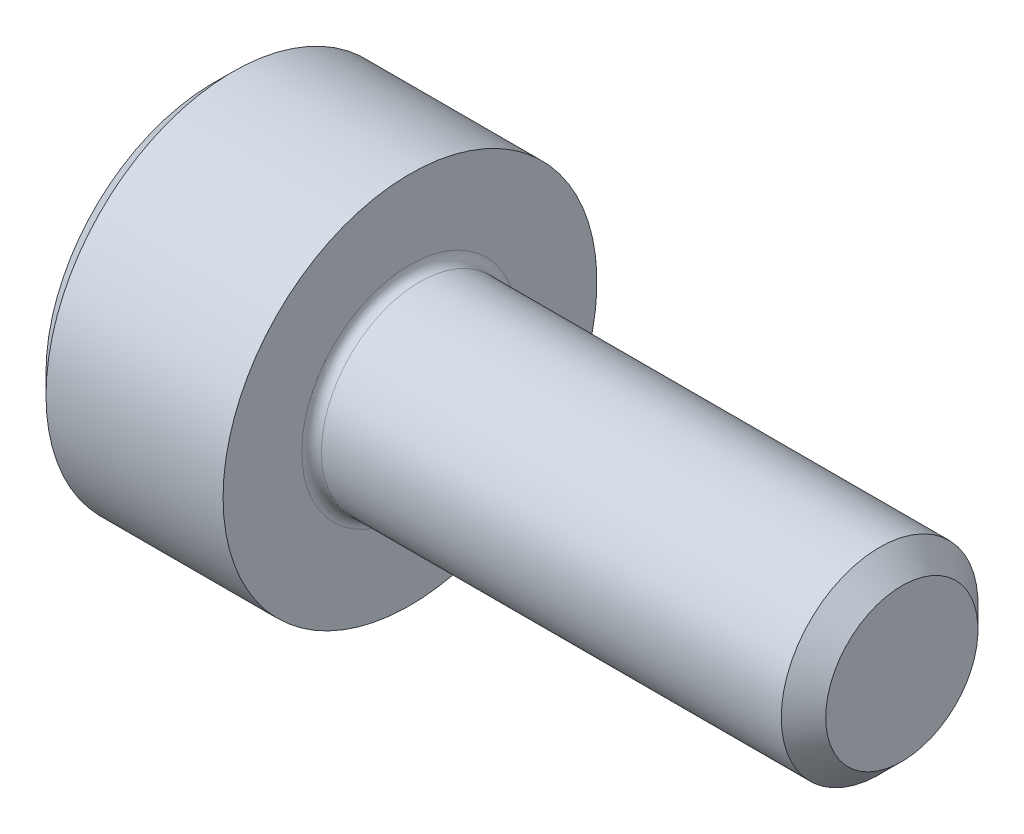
ISO-10303-21;
HEADER;
FILE_DESCRIPTION(('STEP AP214'),'2;1');
FILE_NAME('part.step','',(''),(''),'','','');
FILE_SCHEMA(('AUTOMOTIVE_DESIGN { 1 0 10303 214 1 1 1 1 }'));
ENDSEC;
DATA;
#1=APPLICATION_CONTEXT('core data for automotive mechanical design processes');
#2=APPLICATION_PROTOCOL_DEFINITION('international standard','automotive_design',2000,#1);
#3=PRODUCT_CONTEXT('',#1,'mechanical');
#4=PRODUCT('Part','Part','',(#3));
#5=PRODUCT_RELATED_PRODUCT_CATEGORY('part','',(#4));
#6=PRODUCT_DEFINITION_FORMATION('','',#4);
#7=PRODUCT_DEFINITION_CONTEXT('part definition',#1,'design');
#8=PRODUCT_DEFINITION('design','',#6,#7);
#9=PRODUCT_DEFINITION_SHAPE('','',#8);
#10=(LENGTH_UNIT() NAMED_UNIT(*) SI_UNIT(.MILLI.,.METRE.));
#11=(NAMED_UNIT(*) PLANE_ANGLE_UNIT() SI_UNIT($,.RADIAN.));
#12=(NAMED_UNIT(*) SI_UNIT($,.STERADIAN.) SOLID_ANGLE_UNIT());
#13=UNCERTAINTY_MEASURE_WITH_UNIT(LENGTH_MEASURE(1.E-05),#10,'distance_accuracy_value','');
#14=(GEOMETRIC_REPRESENTATION_CONTEXT(3) GLOBAL_UNCERTAINTY_ASSIGNED_CONTEXT((#13)) GLOBAL_UNIT_ASSIGNED_CONTEXT((#10,
#11,#12)) REPRESENTATION_CONTEXT('',''));
#15=CARTESIAN_POINT('',(0.,0.,0.));
#16=DIRECTION('',(0.,0.,1.));
#17=DIRECTION('',(1.,0.,0.));
#18=AXIS2_PLACEMENT_3D('',#15,#16,#17);
#19=CARTESIAN_POINT('',(0.,0.,0.));
#20=DIRECTION('',(-1.,0.,0.));
#21=DIRECTION('',(0.,0.,1.));
#22=AXIS2_PLACEMENT_3D('',#19,#20,#21);
#23=PLANE('',#22);
#24=DIRECTION('',(0.,-0.499999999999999,0.866025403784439));
#25=VECTOR('',#24,1.);
#26=CARTESIAN_POINT('',(0.,0.892006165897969,0.));
#27=LINE('',#26,#25);
#28=CARTESIAN_POINT('',(0.,0.892006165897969,0.));
#29=VERTEX_POINT('',#28);
#30=CARTESIAN_POINT('',(0.,0.446003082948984,0.772499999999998));
#31=VERTEX_POINT('',#30);
#32=EDGE_CURVE('E265',#29,#31,#27,.T.);
#33=ORIENTED_EDGE('',*,*,#32,.T.);
#34=DIRECTION('',(0.,1.,0.));
#35=VECTOR('',#34,1.);
#36=CARTESIAN_POINT('',(0.,-0.446003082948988,0.772499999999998));
#37=LINE('',#36,#35);
#38=CARTESIAN_POINT('',(0.,-0.446003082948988,0.772499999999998));
#39=VERTEX_POINT('',#38);
#40=EDGE_CURVE('E125',#39,#31,#37,.T.);
#41=ORIENTED_EDGE('',*,*,#40,.F.);
#42=DIRECTION('',(0.,-0.500000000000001,-0.866025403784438));
#43=VECTOR('',#42,1.);
#44=CARTESIAN_POINT('',(0.,-0.446003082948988,0.772499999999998));
#45=LINE('',#44,#43);
#46=CARTESIAN_POINT('',(0.,-0.892006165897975,0.));
#47=VERTEX_POINT('',#46);
#48=EDGE_CURVE('E268',#39,#47,#45,.T.);
#49=ORIENTED_EDGE('',*,*,#48,.T.);
#50=DIRECTION('',(0.,0.499999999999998,-0.866025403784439));
#51=VECTOR('',#50,1.);
#52=CARTESIAN_POINT('',(0.,-0.892006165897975,0.));
#53=LINE('',#52,#51);
#54=CARTESIAN_POINT('',(0.,-0.44600308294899,-0.772500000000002));
#55=VERTEX_POINT('',#54);
#56=EDGE_CURVE('E271',#47,#55,#53,.T.);
#57=ORIENTED_EDGE('',*,*,#56,.T.);
#58=DIRECTION('',(0.,-1.,0.));
#59=VECTOR('',#58,1.);
#60=CARTESIAN_POINT('',(0.,0.446003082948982,-0.772500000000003));
#61=LINE('',#60,#59);
#62=CARTESIAN_POINT('',(0.,0.446003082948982,-0.772500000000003));
#63=VERTEX_POINT('',#62);
#64=EDGE_CURVE('E274',#63,#55,#61,.T.);
#65=ORIENTED_EDGE('',*,*,#64,.F.);
#66=DIRECTION('',(0.,-0.500000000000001,-0.866025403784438));
#67=VECTOR('',#66,1.);
#68=CARTESIAN_POINT('',(0.,0.892006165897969,0.));
#69=LINE('',#68,#67);
#70=EDGE_CURVE('E120',#29,#63,#69,.T.);
#71=ORIENTED_EDGE('',*,*,#70,.F.);
#72=EDGE_LOOP('',(#33,#41,#49,#57,#65,#71));
#73=FACE_BOUND('',#72,.T.);
#74=CARTESIAN_POINT('',(0.,0.,0.));
#75=DIRECTION('',(-1.,0.,0.));
#76=DIRECTION('',(0.,0.,1.));
#77=AXIS2_PLACEMENT_3D('',#74,#75,#76);
#78=CIRCLE('',#77,1.7);
#79=CARTESIAN_POINT('',(0.,0.,1.7));
#80=VERTEX_POINT('',#79);
#81=EDGE_CURVE('E149',#80,#80,#78,.T.);
#82=ORIENTED_EDGE('',*,*,#81,.T.);
#83=EDGE_LOOP('',(#82));
#84=FACE_BOUND('',#83,.T.);
#85=ADVANCED_FACE('F33',(#73,#84),#23,.T.);
#86=CARTESIAN_POINT('',(0.,0.,0.));
#87=DIRECTION('',(1.,0.,0.));
#88=DIRECTION('',(0.,0.,-1.));
#89=AXIS2_PLACEMENT_3D('',#86,#87,#88);
#90=CONICAL_SURFACE('',#89,1.7,0.785398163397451);
#91=CARTESIAN_POINT('',(0.199999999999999,0.,0.));
#92=DIRECTION('',(-1.,0.,0.));
#93=DIRECTION('',(0.,0.,1.));
#94=AXIS2_PLACEMENT_3D('',#91,#92,#93);
#95=CIRCLE('',#94,1.9);
#96=CARTESIAN_POINT('',(0.199999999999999,0.,1.9));
#97=VERTEX_POINT('',#96);
#98=EDGE_CURVE('E146',#97,#97,#95,.T.);
#99=ORIENTED_EDGE('',*,*,#98,.T.);
#100=EDGE_LOOP('',(#99));
#101=FACE_BOUND('',#100,.T.);
#102=ORIENTED_EDGE('',*,*,#81,.F.);
#103=EDGE_LOOP('',(#102));
#104=FACE_BOUND('',#103,.T.);
#105=ADVANCED_FACE('F170',(#101,#104),#90,.T.);
#106=CARTESIAN_POINT('',(-31.75,0.,0.));
#107=DIRECTION('',(-1.,0.,0.));
#108=DIRECTION('',(0.,0.,1.));
#109=AXIS2_PLACEMENT_3D('',#106,#107,#108);
#110=CYLINDRICAL_SURFACE('',#109,1.9);
#111=CARTESIAN_POINT('',(2.,0.,0.));
#112=DIRECTION('',(-1.,0.,0.));
#113=DIRECTION('',(0.,0.,1.));
#114=AXIS2_PLACEMENT_3D('',#111,#112,#113);
#115=CIRCLE('',#114,1.9);
#116=CARTESIAN_POINT('',(2.,0.,1.9));
#117=VERTEX_POINT('',#116);
#118=EDGE_CURVE('E143',#117,#117,#115,.T.);
#119=ORIENTED_EDGE('',*,*,#118,.T.);
#120=EDGE_LOOP('',(#119));
#121=FACE_BOUND('',#120,.T.);
#122=ORIENTED_EDGE('',*,*,#98,.F.);
#123=EDGE_LOOP('',(#122));
#124=FACE_BOUND('',#123,.T.);
#125=ADVANCED_FACE('F175',(#121,#124),#110,.T.);
#126=CARTESIAN_POINT('',(2.,1.9,0.));
#127=DIRECTION('',(1.,0.,0.));
#128=DIRECTION('',(0.,0.,-1.));
#129=AXIS2_PLACEMENT_3D('',#126,#127,#128);
#130=PLANE('',#129);
#131=CARTESIAN_POINT('',(2.,0.,0.));
#132=DIRECTION('',(1.,0.,0.));
#133=DIRECTION('',(0.,0.,-1.));
#134=AXIS2_PLACEMENT_3D('',#131,#132,#133);
#135=CIRCLE('',#134,1.1);
#136=CARTESIAN_POINT('',(2.,0.,-1.1));
#137=VERTEX_POINT('',#136);
#138=EDGE_CURVE('E41',#137,#137,#135,.F.);
#139=ORIENTED_EDGE('',*,*,#138,.T.);
#140=EDGE_LOOP('',(#139));
#141=FACE_BOUND('',#140,.T.);
#142=ORIENTED_EDGE('',*,*,#118,.F.);
#143=EDGE_LOOP('',(#142));
#144=FACE_BOUND('',#143,.T.);
#145=ADVANCED_FACE('F154',(#141,#144),#130,.T.);
#146=CARTESIAN_POINT('',(-31.75,0.,0.));
#147=DIRECTION('',(-1.,0.,0.));
#148=DIRECTION('',(0.,0.,1.));
#149=AXIS2_PLACEMENT_3D('',#146,#147,#148);
#150=CYLINDRICAL_SURFACE('',#149,1.);
#151=CARTESIAN_POINT('',(2.1,0.,0.));
#152=DIRECTION('',(1.,0.,0.));
#153=DIRECTION('',(0.,0.,-1.));
#154=AXIS2_PLACEMENT_3D('',#151,#152,#153);
#155=CIRCLE('',#154,1.);
#156=CARTESIAN_POINT('',(2.1,0.,-1.));
#157=VERTEX_POINT('',#156);
#158=EDGE_CURVE('E11',#157,#157,#155,.T.);
#159=ORIENTED_EDGE('',*,*,#158,.T.);
#160=EDGE_LOOP('',(#159));
#161=FACE_BOUND('',#160,.T.);
#162=CARTESIAN_POINT('',(6.77400000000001,0.,0.));
#163=DIRECTION('',(-1.,0.,0.));
#164=DIRECTION('',(0.,0.,1.));
#165=AXIS2_PLACEMENT_3D('',#162,#163,#164);
#166=CIRCLE('',#165,1.);
#167=CARTESIAN_POINT('',(6.77400000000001,0.,1.));
#168=VERTEX_POINT('',#167);
#169=EDGE_CURVE('E140',#168,#168,#166,.T.);
#170=ORIENTED_EDGE('',*,*,#169,.T.);
#171=EDGE_LOOP('',(#170));
#172=FACE_BOUND('',#171,.T.);
#173=ADVANCED_FACE('F185',(#161,#172),#150,.T.);
#174=CARTESIAN_POINT('',(7.,0.,0.));
#175=DIRECTION('',(-1.,0.,0.));
#176=DIRECTION('',(0.,0.,1.));
#177=AXIS2_PLACEMENT_3D('',#174,#175,#176);
#178=CONICAL_SURFACE('',#177,0.774,0.785398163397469);
#179=ORIENTED_EDGE('',*,*,#169,.F.);
#180=EDGE_LOOP('',(#179));
#181=FACE_BOUND('',#180,.T.);
#182=CARTESIAN_POINT('',(7.,0.,0.));
#183=DIRECTION('',(-1.,0.,0.));
#184=DIRECTION('',(0.,0.,1.));
#185=AXIS2_PLACEMENT_3D('',#182,#183,#184);
#186=CIRCLE('',#185,0.774);
#187=CARTESIAN_POINT('',(7.,0.,0.774));
#188=VERTEX_POINT('',#187);
#189=EDGE_CURVE('E136',#188,#188,#186,.T.);
#190=ORIENTED_EDGE('',*,*,#189,.T.);
#191=EDGE_LOOP('',(#190));
#192=FACE_BOUND('',#191,.T.);
#193=ADVANCED_FACE('F165',(#181,#192),#178,.T.);
#194=CARTESIAN_POINT('',(7.,0.774,0.));
#195=DIRECTION('',(1.,0.,0.));
#196=DIRECTION('',(0.,0.,-1.));
#197=AXIS2_PLACEMENT_3D('',#194,#195,#196);
#198=PLANE('',#197);
#199=ORIENTED_EDGE('',*,*,#189,.F.);
#200=EDGE_LOOP('',(#199));
#201=FACE_BOUND('',#200,.T.);
#202=ADVANCED_FACE('F158',(#201),#198,.T.);
#203=CARTESIAN_POINT('',(2.1,0.,0.));
#204=DIRECTION('',(1.,0.,0.));
#205=DIRECTION('',(0.,0.,-1.));
#206=AXIS2_PLACEMENT_3D('',#203,#204,#205);
#207=TOROIDAL_SURFACE('',#206,1.1,0.1);
#208=ORIENTED_EDGE('',*,*,#158,.F.);
#209=EDGE_LOOP('',(#208));
#210=FACE_BOUND('',#209,.T.);
#211=ORIENTED_EDGE('',*,*,#138,.F.);
#212=EDGE_LOOP('',(#211));
#213=FACE_BOUND('',#212,.T.);
#214=ADVANCED_FACE('F35',(#210,#213),#207,.F.);
#215=CARTESIAN_POINT('',(1.,0.892006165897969,0.));
#216=DIRECTION('',(0.,-0.866025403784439,-0.499999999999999));
#217=DIRECTION('',(0.,0.499999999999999,-0.866025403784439));
#218=AXIS2_PLACEMENT_3D('',#215,#216,#217);
#219=PLANE('',#218);
#220=ORIENTED_EDGE('',*,*,#32,.F.);
#221=DIRECTION('',(-1.,0.,0.));
#222=VECTOR('',#221,1.);
#223=CARTESIAN_POINT('',(1.,0.892006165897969,0.));
#224=LINE('',#223,#222);
#225=CARTESIAN_POINT('',(1.,0.892006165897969,0.));
#226=VERTEX_POINT('',#225);
#227=EDGE_CURVE('E264',#226,#29,#224,.T.);
#228=ORIENTED_EDGE('',*,*,#227,.F.);
#229=DIRECTION('',(0.,-0.499999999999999,0.866025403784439));
#230=VECTOR('',#229,1.);
#231=CARTESIAN_POINT('',(1.,0.892006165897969,0.));
#232=LINE('',#231,#230);
#233=CARTESIAN_POINT('',(1.,0.669004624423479,0.386249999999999));
#234=VERTEX_POINT('',#233);
#235=EDGE_CURVE('E48',#226,#234,#232,.T.);
#236=ORIENTED_EDGE('',*,*,#235,.T.);
#237=CARTESIAN_POINT('',(1.,0.446003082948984,0.772499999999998));
#238=VERTEX_POINT('',#237);
#239=EDGE_CURVE('E106',#234,#238,#232,.T.);
#240=ORIENTED_EDGE('',*,*,#239,.T.);
#241=DIRECTION('',(-1.,0.,0.));
#242=VECTOR('',#241,1.);
#243=CARTESIAN_POINT('',(1.,0.446003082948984,0.772499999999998));
#244=LINE('',#243,#242);
#245=EDGE_CURVE('E118',#238,#31,#244,.T.);
#246=ORIENTED_EDGE('',*,*,#245,.T.);
#247=EDGE_LOOP('',(#220,#228,#236,#240,#246));
#248=FACE_BOUND('',#247,.T.);
#249=ADVANCED_FACE('F117',(#248),#219,.T.);
#250=CARTESIAN_POINT('',(1.,-0.446003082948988,0.772499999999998));
#251=DIRECTION('',(0.,0.,1.));
#252=DIRECTION('',(0.,-1.,0.));
#253=AXIS2_PLACEMENT_3D('',#250,#251,#252);
#254=PLANE('',#253);
#255=ORIENTED_EDGE('',*,*,#40,.T.);
#256=ORIENTED_EDGE('',*,*,#245,.F.);
#257=DIRECTION('',(0.,1.,0.));
#258=VECTOR('',#257,1.);
#259=CARTESIAN_POINT('',(1.,-0.446003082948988,0.772499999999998));
#260=LINE('',#259,#258);
#261=CARTESIAN_POINT('',(1.,0.,0.772499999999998));
#262=VERTEX_POINT('',#261);
#263=EDGE_CURVE('E104',#262,#238,#260,.T.);
#264=ORIENTED_EDGE('',*,*,#263,.F.);
#265=CARTESIAN_POINT('',(1.,-0.446003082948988,0.772499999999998));
#266=VERTEX_POINT('',#265);
#267=EDGE_CURVE('E114',#266,#262,#260,.T.);
#268=ORIENTED_EDGE('',*,*,#267,.F.);
#269=DIRECTION('',(-1.,0.,0.));
#270=VECTOR('',#269,1.);
#271=CARTESIAN_POINT('',(1.,-0.446003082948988,0.772499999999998));
#272=LINE('',#271,#270);
#273=EDGE_CURVE('E127',#266,#39,#272,.T.);
#274=ORIENTED_EDGE('',*,*,#273,.T.);
#275=EDGE_LOOP('',(#255,#256,#264,#268,#274));
#276=FACE_BOUND('',#275,.T.);
#277=ADVANCED_FACE('F122',(#276),#254,.F.);
#278=CARTESIAN_POINT('',(1.,-0.446003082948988,0.772499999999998));
#279=DIRECTION('',(0.,0.866025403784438,-0.500000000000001));
#280=DIRECTION('',(0.,0.500000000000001,0.866025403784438));
#281=AXIS2_PLACEMENT_3D('',#278,#279,#280);
#282=PLANE('',#281);
#283=ORIENTED_EDGE('',*,*,#48,.F.);
#284=ORIENTED_EDGE('',*,*,#273,.F.);
#285=DIRECTION('',(0.,-0.500000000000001,-0.866025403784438));
#286=VECTOR('',#285,1.);
#287=CARTESIAN_POINT('',(1.,-0.446003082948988,0.772499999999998));
#288=LINE('',#287,#286);
#289=CARTESIAN_POINT('',(1.,-0.66900462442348,0.386250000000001));
#290=VERTEX_POINT('',#289);
#291=EDGE_CURVE('E245',#266,#290,#288,.T.);
#292=ORIENTED_EDGE('',*,*,#291,.T.);
#293=CARTESIAN_POINT('',(1.,-0.892006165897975,0.));
#294=VERTEX_POINT('',#293);
#295=EDGE_CURVE('E247',#290,#294,#288,.T.);
#296=ORIENTED_EDGE('',*,*,#295,.T.);
#297=DIRECTION('',(-1.,0.,0.));
#298=VECTOR('',#297,1.);
#299=CARTESIAN_POINT('',(1.,-0.892006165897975,0.));
#300=LINE('',#299,#298);
#301=EDGE_CURVE('E132',#294,#47,#300,.T.);
#302=ORIENTED_EDGE('',*,*,#301,.T.);
#303=EDGE_LOOP('',(#283,#284,#292,#296,#302));
#304=FACE_BOUND('',#303,.T.);
#305=ADVANCED_FACE('F197',(#304),#282,.T.);
#306=CARTESIAN_POINT('',(1.,-0.892006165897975,0.));
#307=DIRECTION('',(0.,0.866025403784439,0.499999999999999));
#308=DIRECTION('',(0.,-0.499999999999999,0.866025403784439));
#309=AXIS2_PLACEMENT_3D('',#306,#307,#308);
#310=PLANE('',#309);
#311=ORIENTED_EDGE('',*,*,#56,.F.);
#312=ORIENTED_EDGE('',*,*,#301,.F.);
#313=DIRECTION('',(0.,0.499999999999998,-0.866025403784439));
#314=VECTOR('',#313,1.);
#315=CARTESIAN_POINT('',(1.,-0.892006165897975,0.));
#316=LINE('',#315,#314);
#317=CARTESIAN_POINT('',(1.,-0.669004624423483,-0.386250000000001));
#318=VERTEX_POINT('',#317);
#319=EDGE_CURVE('E250',#294,#318,#316,.T.);
#320=ORIENTED_EDGE('',*,*,#319,.T.);
#321=CARTESIAN_POINT('',(1.,-0.44600308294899,-0.772500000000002));
#322=VERTEX_POINT('',#321);
#323=EDGE_CURVE('E254',#318,#322,#316,.T.);
#324=ORIENTED_EDGE('',*,*,#323,.T.);
#325=DIRECTION('',(-1.,0.,0.));
#326=VECTOR('',#325,1.);
#327=CARTESIAN_POINT('',(1.,-0.44600308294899,-0.772500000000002));
#328=LINE('',#327,#326);
#329=EDGE_CURVE('E283',#322,#55,#328,.T.);
#330=ORIENTED_EDGE('',*,*,#329,.T.);
#331=EDGE_LOOP('',(#311,#312,#320,#324,#330));
#332=FACE_BOUND('',#331,.T.);
#333=ADVANCED_FACE('F200',(#332),#310,.T.);
#334=CARTESIAN_POINT('',(1.,0.446003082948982,-0.772500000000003));
#335=DIRECTION('',(0.,0.,-1.));
#336=DIRECTION('',(0.,1.,0.));
#337=AXIS2_PLACEMENT_3D('',#334,#335,#336);
#338=PLANE('',#337);
#339=ORIENTED_EDGE('',*,*,#64,.T.);
#340=ORIENTED_EDGE('',*,*,#329,.F.);
#341=DIRECTION('',(0.,-1.,0.));
#342=VECTOR('',#341,1.);
#343=CARTESIAN_POINT('',(1.,0.446003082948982,-0.772500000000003));
#344=LINE('',#343,#342);
#345=CARTESIAN_POINT('',(1.,0.,-0.772500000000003));
#346=VERTEX_POINT('',#345);
#347=EDGE_CURVE('E258',#346,#322,#344,.T.);
#348=ORIENTED_EDGE('',*,*,#347,.F.);
#349=CARTESIAN_POINT('',(1.,0.446003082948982,-0.772500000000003));
#350=VERTEX_POINT('',#349);
#351=EDGE_CURVE('E259',#350,#346,#344,.T.);
#352=ORIENTED_EDGE('',*,*,#351,.F.);
#353=DIRECTION('',(-1.,0.,0.));
#354=VECTOR('',#353,1.);
#355=CARTESIAN_POINT('',(1.,0.446003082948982,-0.772500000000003));
#356=LINE('',#355,#354);
#357=EDGE_CURVE('E280',#350,#63,#356,.T.);
#358=ORIENTED_EDGE('',*,*,#357,.T.);
#359=EDGE_LOOP('',(#339,#340,#348,#352,#358));
#360=FACE_BOUND('',#359,.T.);
#361=ADVANCED_FACE('F204',(#360),#338,.F.);
#362=CARTESIAN_POINT('',(1.,0.892006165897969,0.));
#363=DIRECTION('',(0.,0.866025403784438,-0.500000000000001));
#364=DIRECTION('',(0.,0.500000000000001,0.866025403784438));
#365=AXIS2_PLACEMENT_3D('',#362,#363,#364);
#366=PLANE('',#365);
#367=ORIENTED_EDGE('',*,*,#70,.T.);
#368=ORIENTED_EDGE('',*,*,#357,.F.);
#369=DIRECTION('',(0.,-0.500000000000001,-0.866025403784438));
#370=VECTOR('',#369,1.);
#371=CARTESIAN_POINT('',(1.,0.892006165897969,0.));
#372=LINE('',#371,#370);
#373=CARTESIAN_POINT('',(1.,0.669004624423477,-0.38625));
#374=VERTEX_POINT('',#373);
#375=EDGE_CURVE('E262',#374,#350,#372,.T.);
#376=ORIENTED_EDGE('',*,*,#375,.F.);
#377=EDGE_CURVE('E236',#226,#374,#372,.T.);
#378=ORIENTED_EDGE('',*,*,#377,.F.);
#379=ORIENTED_EDGE('',*,*,#227,.T.);
#380=EDGE_LOOP('',(#367,#368,#376,#378,#379));
#381=FACE_BOUND('',#380,.T.);
#382=ADVANCED_FACE('F208',(#381),#366,.F.);
#383=CARTESIAN_POINT('',(1.,0.446003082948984,0.772499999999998));
#384=DIRECTION('',(-1.,0.,0.));
#385=DIRECTION('',(0.,0.,1.));
#386=AXIS2_PLACEMENT_3D('',#383,#384,#385);
#387=PLANE('',#386);
#388=CARTESIAN_POINT('',(1.,0.,0.));
#389=DIRECTION('',(-1.,0.,0.));
#390=DIRECTION('',(0.,0.,1.));
#391=AXIS2_PLACEMENT_3D('',#388,#389,#390);
#392=CIRCLE('',#391,0.7725);
#393=EDGE_CURVE('E126',#290,#262,#392,.T.);
#394=ORIENTED_EDGE('',*,*,#393,.F.);
#395=ORIENTED_EDGE('',*,*,#291,.F.);
#396=ORIENTED_EDGE('',*,*,#267,.T.);
#397=EDGE_LOOP('',(#394,#395,#396));
#398=FACE_BOUND('',#397,.T.);
#399=ADVANCED_FACE('F212',(#398),#387,.T.);
#400=EDGE_CURVE('E130',#318,#290,#392,.T.);
#401=ORIENTED_EDGE('',*,*,#400,.F.);
#402=ORIENTED_EDGE('',*,*,#319,.F.);
#403=ORIENTED_EDGE('',*,*,#295,.F.);
#404=EDGE_LOOP('',(#401,#402,#403));
#405=FACE_BOUND('',#404,.T.);
#406=ADVANCED_FACE('F215',(#405),#387,.T.);
#407=EDGE_CURVE('E289',#346,#318,#392,.T.);
#408=ORIENTED_EDGE('',*,*,#407,.F.);
#409=ORIENTED_EDGE('',*,*,#347,.T.);
#410=ORIENTED_EDGE('',*,*,#323,.F.);
#411=EDGE_LOOP('',(#408,#409,#410));
#412=FACE_BOUND('',#411,.T.);
#413=ADVANCED_FACE('F220',(#412),#387,.T.);
#414=EDGE_CURVE('E239',#374,#346,#392,.T.);
#415=ORIENTED_EDGE('',*,*,#414,.F.);
#416=ORIENTED_EDGE('',*,*,#375,.T.);
#417=ORIENTED_EDGE('',*,*,#351,.T.);
#418=EDGE_LOOP('',(#415,#416,#417));
#419=FACE_BOUND('',#418,.T.);
#420=ADVANCED_FACE('F227',(#419),#387,.T.);
#421=EDGE_CURVE('E137',#234,#374,#392,.T.);
#422=ORIENTED_EDGE('',*,*,#421,.F.);
#423=ORIENTED_EDGE('',*,*,#235,.F.);
#424=ORIENTED_EDGE('',*,*,#377,.T.);
#425=EDGE_LOOP('',(#422,#423,#424));
#426=FACE_BOUND('',#425,.T.);
#427=ADVANCED_FACE('F223',(#426),#387,.T.);
#428=EDGE_CURVE('E109',#262,#234,#392,.T.);
#429=ORIENTED_EDGE('',*,*,#428,.F.);
#430=ORIENTED_EDGE('',*,*,#263,.T.);
#431=ORIENTED_EDGE('',*,*,#239,.F.);
#432=EDGE_LOOP('',(#429,#430,#431));
#433=FACE_BOUND('',#432,.T.);
#434=ADVANCED_FACE('F105',(#433),#387,.T.);
#435=CARTESIAN_POINT('',(1.,0.,0.));
#436=DIRECTION('',(-1.,0.,0.));
#437=DIRECTION('',(0.,0.,1.));
#438=AXIS2_PLACEMENT_3D('',#435,#436,#437);
#439=CONICAL_SURFACE('',#438,0.7725,1.04719755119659);
#440=CARTESIAN_POINT('',(1.446003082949,0.,0.));
#441=VERTEX_POINT('',#440);
#442=VERTEX_LOOP('',#441);
#443=FACE_BOUND('',#442,.T.);
#444=ORIENTED_EDGE('',*,*,#428,.T.);
#445=ORIENTED_EDGE('',*,*,#421,.T.);
#446=ORIENTED_EDGE('',*,*,#414,.T.);
#447=ORIENTED_EDGE('',*,*,#407,.T.);
#448=ORIENTED_EDGE('',*,*,#400,.T.);
#449=ORIENTED_EDGE('',*,*,#393,.T.);
#450=EDGE_LOOP('',(#444,#445,#446,#447,#448,#449));
#451=FACE_BOUND('',#450,.T.);
#452=ADVANCED_FACE('F192',(#443,#451),#439,.F.);
#453=CLOSED_SHELL('',(#85,#105,#125,#145,#173,#193,#202,#214,#249,#277,#305,#333,#361,#382,#399,
#406,#413,#420,#427,#434,#452));
#454=MANIFOLD_SOLID_BREP('B2',#453);
#455=ADVANCED_BREP_SHAPE_REPRESENTATION('',(#18,#454),#14);
#456=SHAPE_DEFINITION_REPRESENTATION(#9,#455);
ENDSEC;
END-ISO-10303-21;
